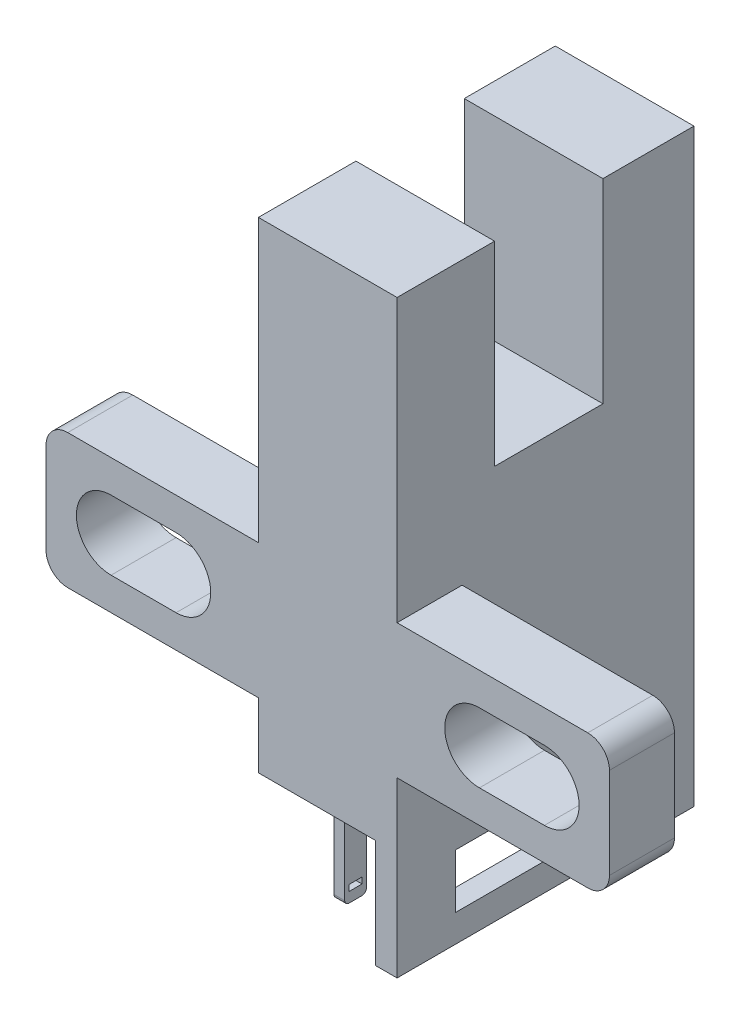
from build123d import *

# Parameters (mm, degrees)
SKETCH_1_W             = 26
SKETCH_1_H             = 6.2
EXTRUDE_1_DEPTH        = 3
FILLET_1_R             = 1
SKETCH_2_W             = 6.4
SKETCH_2_H             = 22.2
EXTRUDE_2_DEPTH        = 13.7
SKETCH_3_W             = 1
SKETCH_3_H             = 13.7
EXTRUDE_3_DEPTH        = 5
SKETCH_4_W             = 8
SKETCH_4_H             = 2.5
CUT_EXTRUDE_1_DEPTH    = 5
EXTRUDE_4_DEPTH        = 0.5
SKETCH_6_W             = 0.8
SKETCH_6_H             = 0.3
CUT_EXTRUDE_2_DEPTH    = 0.5
EXTRUDE_5_DEPTH        = 0.5
SKETCH_8_W             = 0.6
SKETCH_8_H             = 0.279904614
CUT_EXTRUDE_3_DEPTH    = 0.5
PATTERN_LINEAR_1_COUNT = 3
PATTERN_LINEAR_1_PITCH = 3
CUT_EXTRUDE_4_DEPTH    = 3
SKETCH_10_W            = 5
SKETCH_10_H            = 18
CUT_EXTRUDE_5_DEPTH    = 6.4


with BuildPart() as part:
    # Sketch 1 → Extrude 1 (new body)
    with BuildSketch(Plane.XY):
        Rectangle(SKETCH_1_W, SKETCH_1_H)
    extrude(amount=EXTRUDE_1_DEPTH)

    # Fillet 1
    fillet_1_edges = [part.edges().sort_by_distance(p)[0] for p in [
        (13, -3.1, 1.5),
        (-13, -3.1, 1.5),
        (-13, 3.1, 1.5),
        (13, 3.1, 1.5),
    ]]
    fillet(fillet_1_edges, radius=FILLET_1_R)

    # Sketch 2 → Extrude 2 (add)
    with BuildSketch(Plane.XY.offset(3)):
        with Locations((0, 5)):
            Rectangle(SKETCH_2_W, SKETCH_2_H)
    extrude(amount=-EXTRUDE_2_DEPTH)

    # Sketch 3 → Extrude 3 (add)
    with BuildSketch(Plane.XZ.offset(6.1)):
        with Locations((2.7, -3.85)):
            Rectangle(SKETCH_3_W, SKETCH_3_H)
    extrude(amount=EXTRUDE_3_DEPTH)

    # Sketch 4 → Cut-Extrude 1 (cut)
    with BuildSketch(Plane.ZY.offset(-2.2)):
        with Locations((-3.7, -8.579751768)):
            Rectangle(SKETCH_4_W, SKETCH_4_H)
    extrude(amount=-CUT_EXTRUDE_1_DEPTH, mode=Mode.SUBTRACT)

    # Sketch 5 → Extrude 4 (add)
    with BuildSketch(Plane.ZY.offset(1.2)):
        with BuildLine():
            Line((-8.483503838, -6.1), (-7.483503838, -6.1))
            Line((-7.483503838, -6.1), (-7.483503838, -10.212060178))
            Line((-7.483503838, -10.212060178), (-7.483503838, -10.723972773))
            ThreePointArc((-7.483503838, -10.723972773), (-7.544966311, -10.872356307), (-7.693349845, -10.93381878))
            Line((-7.693349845, -10.93381878), (-8.283503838, -10.93381878))
            Line((-8.283503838, -10.93381878), (-8.483503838, -10.93381878))
            Line((-8.483503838, -10.93381878), (-9.073657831, -10.93381878))
            ThreePointArc((-9.073657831, -10.93381878), (-9.222041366, -10.872356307), (-9.283503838, -10.723972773))
            Line((-9.283503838, -10.723972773), (-9.283503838, -10.343664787))
            ThreePointArc((-9.283503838, -10.343664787), (-9.222041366, -10.195281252), (-9.073657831, -10.13381878))
            Line((-9.073657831, -10.13381878), (-8.693349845, -10.13381878))
            ThreePointArc((-8.693349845, -10.13381878), (-8.544966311, -10.072356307), (-8.483503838, -9.923972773))
            Line((-8.483503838, -9.923972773), (-8.483503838, -6.1))
        make_face()
    extrude(amount=-EXTRUDE_4_DEPTH)

    # Sketch 6 → Cut-Extrude 2 (cut)
    with BuildSketch(Plane.ZY.offset(1.2)):
        with Locations((-8.383503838, -10.522563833)):
            Rectangle(SKETCH_6_W, SKETCH_6_H)
    extrude(amount=-CUT_EXTRUDE_2_DEPTH, mode=Mode.SUBTRACT)

    # Sketch 7 → Extrude 5 (add)
    with BuildSketch(Plane.ZY.offset(1.2)):
        with BuildLine():
            Line((-4.483503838, -6.1), (-5.483503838, -6.1))
            Line((-5.483503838, -6.1), (-5.483503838, -10.69882865))
            ThreePointArc((-5.483503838, -10.69882865), (-5.424925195, -10.840250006), (-5.283503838, -10.89882865))
            Line((-5.283503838, -10.89882865), (-4.683503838, -10.89882865))
            ThreePointArc((-4.683503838, -10.89882865), (-4.542082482, -10.840250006), (-4.483503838, -10.69882865))
            Line((-4.483503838, -10.69882865), (-4.483503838, -6.1))
        make_face()
        with BuildLine():
            Line((-1.483503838, -6.1), (-2.483503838, -6.1))
            Line((-2.483503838, -6.1), (-2.483503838, -10.69882865))
            ThreePointArc((-2.483503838, -10.69882865), (-2.424925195, -10.840250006), (-2.283503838, -10.89882865))
            Line((-2.283503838, -10.89882865), (-1.683503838, -10.89882865))
            ThreePointArc((-1.683503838, -10.89882865), (-1.542082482, -10.840250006), (-1.483503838, -10.69882865))
            Line((-1.483503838, -10.69882865), (-1.483503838, -6.1))
        make_face()
        with BuildLine():
            Line((1.516496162, -6.1), (0.516496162, -6.1))
            Line((0.516496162, -6.1), (0.516496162, -10.69882865))
            ThreePointArc((0.516496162, -10.69882865), (0.575074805, -10.840250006), (0.716496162, -10.89882865))
            Line((0.716496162, -10.89882865), (1.316496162, -10.89882865))
            ThreePointArc((1.316496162, -10.89882865), (1.457917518, -10.840250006), (1.516496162, -10.69882865))
            Line((1.516496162, -10.69882865), (1.516496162, -6.1))
        make_face()
    extrude(amount=-EXTRUDE_5_DEPTH)

    # Sketch 8 → Cut-Extrude 3 (cut)
    with BuildSketch(Plane.ZY.offset(1.2)):
        with Locations((-4.983503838, -10.293593)):
            Rectangle(SKETCH_8_W, SKETCH_8_H)
    cut_extrude_3 = extrude(amount=-CUT_EXTRUDE_3_DEPTH, mode=Mode.SUBTRACT)

    # Pattern Linear 1: Cut-Extrude 3 ×3
    with Locations(*[(0, 0, i * PATTERN_LINEAR_1_PITCH) for i in range(1, PATTERN_LINEAR_1_COUNT)]):
        add(cut_extrude_3, mode=Mode.SUBTRACT)

    # Sketch 9 → Cut-Extrude 4 (cut)
    with BuildSketch(Plane(origin=(0, 0, 0), x_dir=(-1, 0, 0), z_dir=(0, 0, -1))):
        with BuildLine():
            Line((-10, 1.6), (-7, 1.6))
            ThreePointArc((-7, 1.6), (-5.4, 0), (-7, -1.6))
            Line((-7, -1.6), (-10, -1.6))
            ThreePointArc((-10, -1.6), (-11.6, 0), (-10, 1.6))
        make_face()
    cut_extrude_4 = extrude(amount=-CUT_EXTRUDE_4_DEPTH, mode=Mode.SUBTRACT)

    # Mirror 1: Cut-Extrude 4 across plane
    add(cut_extrude_4.mirror(Plane(origin=(0, 0, 0), x_dir=(0, 0, 1), z_dir=(1, 0, 0))), mode=Mode.SUBTRACT)

    # Sketch 10 → Cut-Extrude 5 (cut)
    with BuildSketch(Plane.ZY.offset(3.2)):
        with Locations((-4, 16.1)):
            Rectangle(SKETCH_10_W, SKETCH_10_H)
    extrude(amount=-CUT_EXTRUDE_5_DEPTH, mode=Mode.SUBTRACT)


solid = part.part
